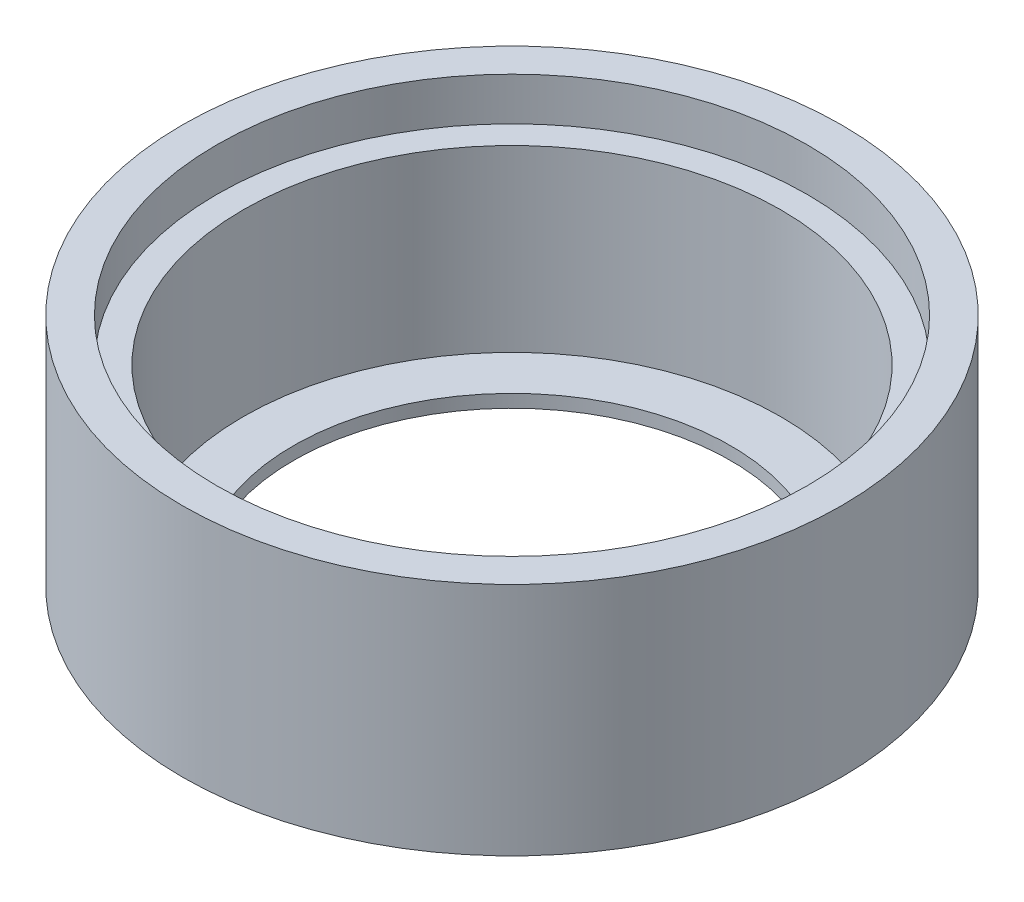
ISO-10303-21;
HEADER;
FILE_DESCRIPTION(('STEP AP214'),'2;1');
FILE_NAME('part.step','',(''),(''),'','','');
FILE_SCHEMA(('AUTOMOTIVE_DESIGN { 1 0 10303 214 1 1 1 1 }'));
ENDSEC;
DATA;
#1=APPLICATION_CONTEXT('core data for automotive mechanical design processes');
#2=APPLICATION_PROTOCOL_DEFINITION('international standard','automotive_design',2000,#1);
#3=PRODUCT_CONTEXT('',#1,'mechanical');
#4=PRODUCT('Part','Part','',(#3));
#5=PRODUCT_RELATED_PRODUCT_CATEGORY('part','',(#4));
#6=PRODUCT_DEFINITION_FORMATION('','',#4);
#7=PRODUCT_DEFINITION_CONTEXT('part definition',#1,'design');
#8=PRODUCT_DEFINITION('design','',#6,#7);
#9=PRODUCT_DEFINITION_SHAPE('','',#8);
#10=(LENGTH_UNIT() NAMED_UNIT(*) SI_UNIT(.MILLI.,.METRE.));
#11=(NAMED_UNIT(*) PLANE_ANGLE_UNIT() SI_UNIT($,.RADIAN.));
#12=(NAMED_UNIT(*) SI_UNIT($,.STERADIAN.) SOLID_ANGLE_UNIT());
#13=UNCERTAINTY_MEASURE_WITH_UNIT(LENGTH_MEASURE(1.E-05),#10,'distance_accuracy_value','');
#14=(GEOMETRIC_REPRESENTATION_CONTEXT(3) GLOBAL_UNCERTAINTY_ASSIGNED_CONTEXT((#13)) GLOBAL_UNIT_ASSIGNED_CONTEXT((#10,
#11,#12)) REPRESENTATION_CONTEXT('',''));
#15=CARTESIAN_POINT('',(0.,0.,0.));
#16=DIRECTION('',(0.,0.,1.));
#17=DIRECTION('',(1.,0.,0.));
#18=AXIS2_PLACEMENT_3D('',#15,#16,#17);
#19=CARTESIAN_POINT('',(0.,4.1656,0.));
#20=DIRECTION('',(0.,-1.,0.));
#21=DIRECTION('',(0.,0.,-1.));
#22=AXIS2_PLACEMENT_3D('',#19,#20,#21);
#23=CYLINDRICAL_SURFACE('',#22,5.842);
#24=CARTESIAN_POINT('',(0.,4.1656,0.));
#25=DIRECTION('',(0.,1.,0.));
#26=DIRECTION('',(0.,0.,1.));
#27=AXIS2_PLACEMENT_3D('',#24,#25,#26);
#28=CIRCLE('',#27,5.842);
#29=CARTESIAN_POINT('',(0.,4.1656,5.842));
#30=VERTEX_POINT('',#29);
#31=EDGE_CURVE('E10',#30,#30,#28,.T.);
#32=ORIENTED_EDGE('',*,*,#31,.F.);
#33=EDGE_LOOP('',(#32));
#34=FACE_BOUND('',#33,.T.);
#35=CARTESIAN_POINT('',(0.,0.,0.));
#36=DIRECTION('',(0.,1.,0.));
#37=DIRECTION('',(0.,0.,1.));
#38=AXIS2_PLACEMENT_3D('',#35,#36,#37);
#39=CIRCLE('',#38,5.842);
#40=CARTESIAN_POINT('',(0.,0.,5.842));
#41=VERTEX_POINT('',#40);
#42=EDGE_CURVE('E34',#41,#41,#39,.T.);
#43=ORIENTED_EDGE('',*,*,#42,.T.);
#44=EDGE_LOOP('',(#43));
#45=FACE_BOUND('',#44,.T.);
#46=ADVANCED_FACE('F31',(#34,#45),#23,.T.);
#47=CARTESIAN_POINT('',(0.,4.1656,0.));
#48=DIRECTION('',(0.,1.,0.));
#49=DIRECTION('',(0.,0.,1.));
#50=AXIS2_PLACEMENT_3D('',#47,#48,#49);
#51=PLANE('',#50);
#52=CARTESIAN_POINT('',(0.,4.1656,0.));
#53=DIRECTION('',(0.,1.,0.));
#54=DIRECTION('',(0.,0.,1.));
#55=AXIS2_PLACEMENT_3D('',#52,#53,#54);
#56=CIRCLE('',#55,5.2324);
#57=CARTESIAN_POINT('',(0.,4.1656,5.2324));
#58=VERTEX_POINT('',#57);
#59=EDGE_CURVE('E43',#58,#58,#56,.T.);
#60=ORIENTED_EDGE('',*,*,#59,.F.);
#61=EDGE_LOOP('',(#60));
#62=FACE_BOUND('',#61,.T.);
#63=ORIENTED_EDGE('',*,*,#31,.T.);
#64=EDGE_LOOP('',(#63));
#65=FACE_BOUND('',#64,.T.);
#66=ADVANCED_FACE('F89',(#62,#65),#51,.T.);
#67=CARTESIAN_POINT('',(0.,0.,0.));
#68=DIRECTION('',(0.,1.,0.));
#69=DIRECTION('',(0.,0.,1.));
#70=AXIS2_PLACEMENT_3D('',#67,#68,#69);
#71=PLANE('',#70);
#72=CARTESIAN_POINT('',(0.,0.,0.));
#73=DIRECTION('',(0.,1.,0.));
#74=DIRECTION('',(0.,0.,1.));
#75=AXIS2_PLACEMENT_3D('',#72,#73,#74);
#76=CIRCLE('',#75,3.8735);
#77=CARTESIAN_POINT('',(0.,0.,3.8735));
#78=VERTEX_POINT('',#77);
#79=EDGE_CURVE('E52',#78,#78,#76,.T.);
#80=ORIENTED_EDGE('',*,*,#79,.T.);
#81=EDGE_LOOP('',(#80));
#82=FACE_BOUND('',#81,.T.);
#83=ORIENTED_EDGE('',*,*,#42,.F.);
#84=EDGE_LOOP('',(#83));
#85=FACE_BOUND('',#84,.T.);
#86=ADVANCED_FACE('F85',(#82,#85),#71,.F.);
#87=CARTESIAN_POINT('',(0.,3.4036,0.));
#88=DIRECTION('',(0.,1.,0.));
#89=DIRECTION('',(0.,0.,1.));
#90=AXIS2_PLACEMENT_3D('',#87,#88,#89);
#91=CYLINDRICAL_SURFACE('',#90,5.2324);
#92=CARTESIAN_POINT('',(0.,3.4036,0.));
#93=DIRECTION('',(0.,1.,0.));
#94=DIRECTION('',(0.,0.,1.));
#95=AXIS2_PLACEMENT_3D('',#92,#93,#94);
#96=CIRCLE('',#95,5.2324);
#97=CARTESIAN_POINT('',(0.,3.4036,5.2324));
#98=VERTEX_POINT('',#97);
#99=EDGE_CURVE('E41',#98,#98,#96,.T.);
#100=CARTESIAN_POINT('',(0.,3.4036,5.2324));
#101=CARTESIAN_POINT('',(0.,3.4115375,5.2324));
#102=CARTESIAN_POINT('',(0.,3.419475,5.2324));
#103=CARTESIAN_POINT('',(0.,3.43535,5.2324));
#104=CARTESIAN_POINT('',(0.,3.4432875,5.2324));
#105=CARTESIAN_POINT('',(0.,3.4591625,5.2324));
#106=CARTESIAN_POINT('',(0.,3.4671,5.2324));
#107=CARTESIAN_POINT('',(0.,3.482975,5.2324));
#108=CARTESIAN_POINT('',(0.,3.4909125,5.2324));
#109=CARTESIAN_POINT('',(0.,3.5067875,5.2324));
#110=CARTESIAN_POINT('',(0.,3.514725,5.2324));
#111=CARTESIAN_POINT('',(0.,3.5306,5.2324));
#112=CARTESIAN_POINT('',(0.,3.5385375,5.2324));
#113=CARTESIAN_POINT('',(0.,3.5544125,5.2324));
#114=CARTESIAN_POINT('',(0.,3.56235,5.2324));
#115=CARTESIAN_POINT('',(0.,3.578225,5.2324));
#116=CARTESIAN_POINT('',(0.,3.5861625,5.2324));
#117=CARTESIAN_POINT('',(0.,3.6020375,5.2324));
#118=CARTESIAN_POINT('',(0.,3.609975,5.2324));
#119=CARTESIAN_POINT('',(0.,3.62585,5.2324));
#120=CARTESIAN_POINT('',(0.,3.6337875,5.2324));
#121=CARTESIAN_POINT('',(0.,3.6496625,5.2324));
#122=CARTESIAN_POINT('',(0.,3.6576,5.2324));
#123=CARTESIAN_POINT('',(0.,3.673475,5.2324));
#124=CARTESIAN_POINT('',(0.,3.6814125,5.2324));
#125=CARTESIAN_POINT('',(0.,3.6972875,5.2324));
#126=CARTESIAN_POINT('',(0.,3.705225,5.2324));
#127=CARTESIAN_POINT('',(0.,3.7211,5.2324));
#128=CARTESIAN_POINT('',(0.,3.7290375,5.2324));
#129=CARTESIAN_POINT('',(0.,3.7449125,5.2324));
#130=CARTESIAN_POINT('',(0.,3.75285,5.2324));
#131=CARTESIAN_POINT('',(0.,3.768725,5.2324));
#132=CARTESIAN_POINT('',(0.,3.7766625,5.2324));
#133=CARTESIAN_POINT('',(0.,3.7925375,5.2324));
#134=CARTESIAN_POINT('',(0.,3.800475,5.2324));
#135=CARTESIAN_POINT('',(0.,3.81635,5.2324));
#136=CARTESIAN_POINT('',(0.,3.8242875,5.2324));
#137=CARTESIAN_POINT('',(0.,3.8401625,5.2324));
#138=CARTESIAN_POINT('',(0.,3.8481,5.2324));
#139=CARTESIAN_POINT('',(0.,3.863975,5.2324));
#140=CARTESIAN_POINT('',(0.,3.8719125,5.2324));
#141=CARTESIAN_POINT('',(0.,3.8877875,5.2324));
#142=CARTESIAN_POINT('',(0.,3.895725,5.2324));
#143=CARTESIAN_POINT('',(0.,3.9116,5.2324));
#144=CARTESIAN_POINT('',(0.,3.9195375,5.2324));
#145=CARTESIAN_POINT('',(0.,3.9354125,5.2324));
#146=CARTESIAN_POINT('',(0.,3.94335,5.2324));
#147=CARTESIAN_POINT('',(0.,3.959225,5.2324));
#148=CARTESIAN_POINT('',(0.,3.9671625,5.2324));
#149=CARTESIAN_POINT('',(0.,3.9830375,5.2324));
#150=CARTESIAN_POINT('',(0.,3.990975,5.2324));
#151=CARTESIAN_POINT('',(0.,4.00685,5.2324));
#152=CARTESIAN_POINT('',(0.,4.0147875,5.2324));
#153=CARTESIAN_POINT('',(0.,4.0306625,5.2324));
#154=CARTESIAN_POINT('',(0.,4.0386,5.2324));
#155=CARTESIAN_POINT('',(0.,4.054475,5.2324));
#156=CARTESIAN_POINT('',(0.,4.0624125,5.2324));
#157=CARTESIAN_POINT('',(0.,4.0782875,5.2324));
#158=CARTESIAN_POINT('',(0.,4.086225,5.2324));
#159=CARTESIAN_POINT('',(0.,4.1021,5.2324));
#160=CARTESIAN_POINT('',(0.,4.1100375,5.2324));
#161=CARTESIAN_POINT('',(0.,4.1259125,5.2324));
#162=CARTESIAN_POINT('',(0.,4.13385,5.2324));
#163=CARTESIAN_POINT('',(0.,4.149725,5.2324));
#164=CARTESIAN_POINT('',(0.,4.1576625,5.2324));
#165=CARTESIAN_POINT('',(0.,4.1656,5.2324));
#166=B_SPLINE_CURVE_WITH_KNOTS('',3,(#100,#101,#102,#103,#104,#105,#106,#107,#108,#109,#110,
#111,#112,#113,#114,#115,#116,#117,#118,#119,#120,#121,#122,#123,#124,#125,#126,#127,#128,#129,
#130,#131,#132,#133,#134,#135,#136,#137,#138,#139,#140,#141,#142,#143,#144,#145,#146,#147,#148,
#149,#150,#151,#152,#153,#154,#155,#156,#157,#158,#159,#160,#161,#162,#163,#164,#165),
.UNSPECIFIED.,.F.,.F.,(4,2,2,2,2,2,2,2,2,2,2,2,2,2,2,2,2,2,2,2,2,2,2,2,2,2,2,2,2,2,2,2,4),(0.,
0.0238125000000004,0.0476250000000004,0.0714375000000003,0.0952500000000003,0.1190625,0.142875,
0.1666875,0.1905,0.2143125,0.238125,0.2619375,0.28575,0.3095625,0.333375,0.3571875,0.381,
0.4048125,0.428625,0.4524375,0.47625,0.5000625,0.523875,0.5476875,0.5715,0.5953125,0.619125,
0.6429375,0.66675,0.6905625,0.714375,0.7381875,0.762),.UNSPECIFIED.);
#167=EDGE_CURVE('BSEAM79',#98,#58,#166,.T.);
#168=ORIENTED_EDGE('',*,*,#99,.F.);
#169=ORIENTED_EDGE('',*,*,#59,.T.);
#170=ORIENTED_EDGE('',*,*,#167,.T.);
#171=ORIENTED_EDGE('',*,*,#167,.F.);
#172=EDGE_LOOP('',(#168,#170,#169,#171));
#173=FACE_BOUND('',#172,.T.);
#174=ADVANCED_FACE('F79',(#173),#91,.F.);
#175=CARTESIAN_POINT('',(0.,3.4036,0.));
#176=DIRECTION('',(0.,1.,0.));
#177=DIRECTION('',(0.,0.,1.));
#178=AXIS2_PLACEMENT_3D('',#175,#176,#177);
#179=PLANE('',#178);
#180=CARTESIAN_POINT('',(0.,3.4036,0.));
#181=DIRECTION('',(0.,1.,0.));
#182=DIRECTION('',(0.,0.,1.));
#183=AXIS2_PLACEMENT_3D('',#180,#181,#182);
#184=CIRCLE('',#183,4.7625);
#185=CARTESIAN_POINT('',(0.,3.4036,4.7625));
#186=VERTEX_POINT('',#185);
#187=EDGE_CURVE('E49',#186,#186,#184,.T.);
#188=ORIENTED_EDGE('',*,*,#187,.F.);
#189=EDGE_LOOP('',(#188));
#190=FACE_BOUND('',#189,.T.);
#191=ORIENTED_EDGE('',*,*,#99,.T.);
#192=EDGE_LOOP('',(#191));
#193=FACE_BOUND('',#192,.T.);
#194=ADVANCED_FACE('F73',(#190,#193),#179,.T.);
#195=CARTESIAN_POINT('',(0.,0.2286,0.));
#196=DIRECTION('',(0.,1.,0.));
#197=DIRECTION('',(0.,0.,1.));
#198=AXIS2_PLACEMENT_3D('',#195,#196,#197);
#199=CYLINDRICAL_SURFACE('',#198,4.7625);
#200=CARTESIAN_POINT('',(0.,0.2286,0.));
#201=DIRECTION('',(0.,1.,0.));
#202=DIRECTION('',(0.,0.,1.));
#203=AXIS2_PLACEMENT_3D('',#200,#201,#202);
#204=CIRCLE('',#203,4.7625);
#205=CARTESIAN_POINT('',(0.,0.2286,4.7625));
#206=VERTEX_POINT('',#205);
#207=EDGE_CURVE('E46',#206,#206,#204,.T.);
#208=ORIENTED_EDGE('',*,*,#207,.F.);
#209=EDGE_LOOP('',(#208));
#210=FACE_BOUND('',#209,.T.);
#211=ORIENTED_EDGE('',*,*,#187,.T.);
#212=EDGE_LOOP('',(#211));
#213=FACE_BOUND('',#212,.T.);
#214=ADVANCED_FACE('F67',(#210,#213),#199,.F.);
#215=CARTESIAN_POINT('',(0.,0.2286,0.));
#216=DIRECTION('',(0.,1.,0.));
#217=DIRECTION('',(0.,0.,1.));
#218=AXIS2_PLACEMENT_3D('',#215,#216,#217);
#219=PLANE('',#218);
#220=CARTESIAN_POINT('',(0.,0.2286,0.));
#221=DIRECTION('',(0.,1.,0.));
#222=DIRECTION('',(0.,0.,1.));
#223=AXIS2_PLACEMENT_3D('',#220,#221,#222);
#224=CIRCLE('',#223,3.8735);
#225=CARTESIAN_POINT('',(0.,0.2286,3.8735));
#226=VERTEX_POINT('',#225);
#227=EDGE_CURVE('E57',#226,#226,#224,.T.);
#228=ORIENTED_EDGE('',*,*,#227,.F.);
#229=EDGE_LOOP('',(#228));
#230=FACE_BOUND('',#229,.T.);
#231=ORIENTED_EDGE('',*,*,#207,.T.);
#232=EDGE_LOOP('',(#231));
#233=FACE_BOUND('',#232,.T.);
#234=ADVANCED_FACE('F64',(#230,#233),#219,.T.);
#235=CARTESIAN_POINT('',(0.,-2.9464,0.));
#236=DIRECTION('',(0.,1.,0.));
#237=DIRECTION('',(0.,0.,1.));
#238=AXIS2_PLACEMENT_3D('',#235,#236,#237);
#239=CYLINDRICAL_SURFACE('',#238,3.8735);
#240=ORIENTED_EDGE('',*,*,#227,.T.);
#241=EDGE_LOOP('',(#240));
#242=FACE_BOUND('',#241,.T.);
#243=ORIENTED_EDGE('',*,*,#79,.F.);
#244=EDGE_LOOP('',(#243));
#245=FACE_BOUND('',#244,.T.);
#246=ADVANCED_FACE('F61',(#242,#245),#239,.F.);
#247=CLOSED_SHELL('',(#46,#66,#86,#174,#194,#214,#234,#246));
#248=MANIFOLD_SOLID_BREP('B2',#247);
#249=ADVANCED_BREP_SHAPE_REPRESENTATION('',(#18,#248),#14);
#250=SHAPE_DEFINITION_REPRESENTATION(#9,#249);
ENDSEC;
END-ISO-10303-21;
